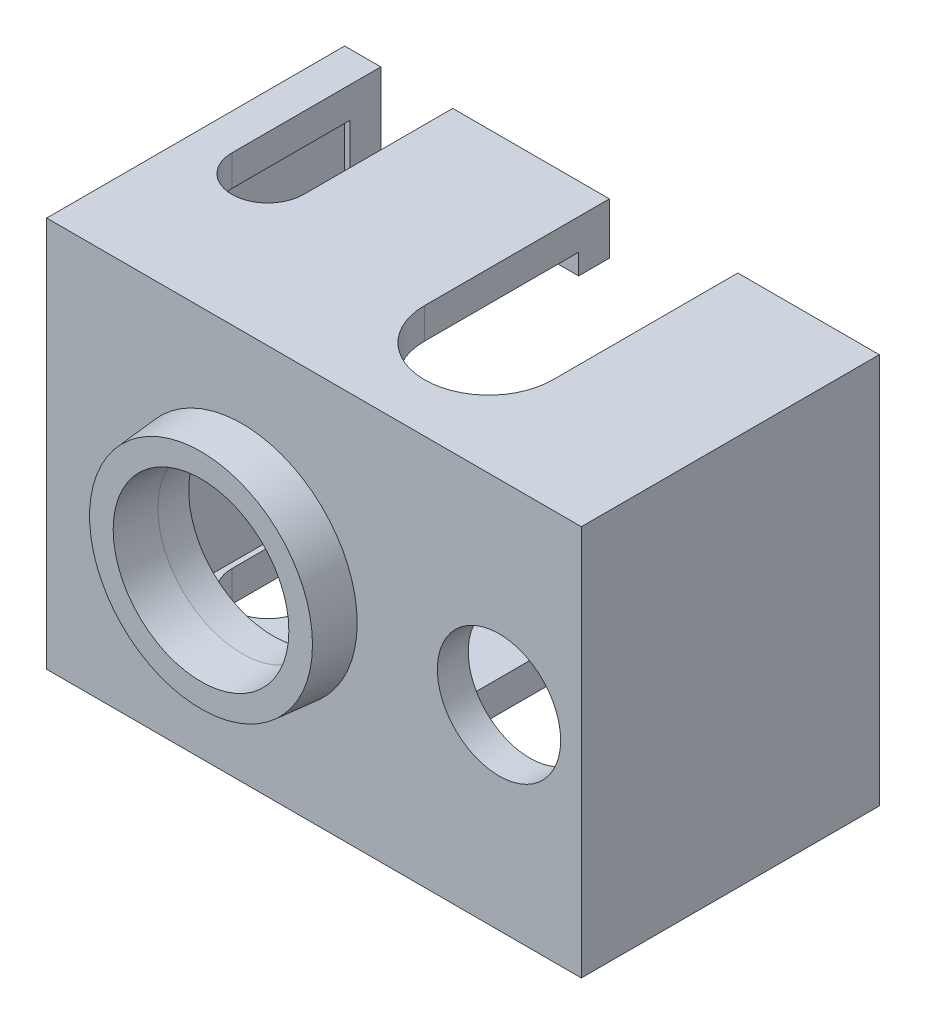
ISO-10303-21;
HEADER;
FILE_DESCRIPTION(('STEP AP214'),'2;1');
FILE_NAME('part.step','',(''),(''),'','','');
FILE_SCHEMA(('AUTOMOTIVE_DESIGN { 1 0 10303 214 1 1 1 1 }'));
ENDSEC;
DATA;
#1=APPLICATION_CONTEXT('core data for automotive mechanical design processes');
#2=APPLICATION_PROTOCOL_DEFINITION('international standard','automotive_design',2000,#1);
#3=PRODUCT_CONTEXT('',#1,'mechanical');
#4=PRODUCT('Part','Part','',(#3));
#5=PRODUCT_RELATED_PRODUCT_CATEGORY('part','',(#4));
#6=PRODUCT_DEFINITION_FORMATION('','',#4);
#7=PRODUCT_DEFINITION_CONTEXT('part definition',#1,'design');
#8=PRODUCT_DEFINITION('design','',#6,#7);
#9=PRODUCT_DEFINITION_SHAPE('','',#8);
#10=(LENGTH_UNIT() NAMED_UNIT(*) SI_UNIT(.MILLI.,.METRE.));
#11=(NAMED_UNIT(*) PLANE_ANGLE_UNIT() SI_UNIT($,.RADIAN.));
#12=(NAMED_UNIT(*) SI_UNIT($,.STERADIAN.) SOLID_ANGLE_UNIT());
#13=UNCERTAINTY_MEASURE_WITH_UNIT(LENGTH_MEASURE(1.E-05),#10,'distance_accuracy_value','');
#14=(GEOMETRIC_REPRESENTATION_CONTEXT(3) GLOBAL_UNCERTAINTY_ASSIGNED_CONTEXT((#13)) GLOBAL_UNIT_ASSIGNED_CONTEXT((#10,
#11,#12)) REPRESENTATION_CONTEXT('',''));
#15=CARTESIAN_POINT('',(0.,0.,0.));
#16=DIRECTION('',(0.,0.,1.));
#17=DIRECTION('',(1.,0.,0.));
#18=AXIS2_PLACEMENT_3D('',#15,#16,#17);
#19=CARTESIAN_POINT('',(0.,0.,-11.5));
#20=DIRECTION('',(0.,0.,-1.));
#21=DIRECTION('',(-1.,0.,0.));
#22=AXIS2_PLACEMENT_3D('',#19,#20,#21);
#23=PLANE('',#22);
#24=DIRECTION('',(-1.,0.,0.));
#25=VECTOR('',#24,1.);
#26=CARTESIAN_POINT('',(15.01,8.01,-11.5));
#27=LINE('',#26,#25);
#28=CARTESIAN_POINT('',(15.01,8.01,-11.5));
#29=VERTEX_POINT('',#28);
#30=CARTESIAN_POINT('',(9.62500000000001,8.01,-11.5));
#31=VERTEX_POINT('',#30);
#32=EDGE_CURVE('E449',#29,#31,#27,.T.);
#33=ORIENTED_EDGE('',*,*,#32,.T.);
#34=DIRECTION('',(0.,-1.,0.));
#35=VECTOR('',#34,1.);
#36=CARTESIAN_POINT('',(9.62500000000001,0.,-11.5));
#37=LINE('',#36,#35);
#38=CARTESIAN_POINT('',(9.62500000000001,7.01,-11.5));
#39=VERTEX_POINT('',#38);
#40=EDGE_CURVE('E341',#31,#39,#37,.T.);
#41=ORIENTED_EDGE('',*,*,#40,.T.);
#42=DIRECTION('',(1.,0.,0.));
#43=VECTOR('',#42,1.);
#44=CARTESIAN_POINT('',(-7.01,7.00999999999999,-11.5));
#45=LINE('',#44,#43);
#46=CARTESIAN_POINT('',(14.01,7.01,-11.5));
#47=VERTEX_POINT('',#46);
#48=EDGE_CURVE('E416',#39,#47,#45,.T.);
#49=ORIENTED_EDGE('',*,*,#48,.T.);
#50=DIRECTION('',(0.,-1.,0.));
#51=VECTOR('',#50,1.);
#52=CARTESIAN_POINT('',(14.01,7.01,-11.5));
#53=LINE('',#52,#51);
#54=CARTESIAN_POINT('',(14.01,-7.01,-11.5));
#55=VERTEX_POINT('',#54);
#56=EDGE_CURVE('E419',#47,#55,#53,.T.);
#57=ORIENTED_EDGE('',*,*,#56,.T.);
#58=DIRECTION('',(-1.,0.,0.));
#59=VECTOR('',#58,1.);
#60=CARTESIAN_POINT('',(14.01,-7.01,-11.5));
#61=LINE('',#60,#59);
#62=CARTESIAN_POINT('',(9.62500000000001,-7.01,-11.5));
#63=VERTEX_POINT('',#62);
#64=EDGE_CURVE('E413',#55,#63,#61,.T.);
#65=ORIENTED_EDGE('',*,*,#64,.T.);
#66=CARTESIAN_POINT('',(9.62500000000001,-8.01,-11.5));
#67=VERTEX_POINT('',#66);
#68=EDGE_CURVE('E345',#63,#67,#37,.T.);
#69=ORIENTED_EDGE('',*,*,#68,.T.);
#70=DIRECTION('',(1.,0.,0.));
#71=VECTOR('',#70,1.);
#72=CARTESIAN_POINT('',(15.01,-8.01,-11.5));
#73=LINE('',#72,#71);
#74=CARTESIAN_POINT('',(15.01,-8.01,-11.5));
#75=VERTEX_POINT('',#74);
#76=EDGE_CURVE('E456',#67,#75,#73,.T.);
#77=ORIENTED_EDGE('',*,*,#76,.T.);
#78=DIRECTION('',(0.,1.,0.));
#79=VECTOR('',#78,1.);
#80=CARTESIAN_POINT('',(15.01,8.01,-11.5));
#81=LINE('',#80,#79);
#82=EDGE_CURVE('E444',#75,#29,#81,.T.);
#83=ORIENTED_EDGE('',*,*,#82,.T.);
#84=EDGE_LOOP('',(#33,#41,#49,#57,#65,#69,#77,#83));
#85=FACE_BOUND('',#84,.T.);
#86=ADVANCED_FACE('F33',(#85),#23,.F.);
#87=CARTESIAN_POINT('',(-4.25000000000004,-8.01,-11.5));
#88=VERTEX_POINT('',#87);
#89=CARTESIAN_POINT('',(3.37500000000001,-8.01,-11.5));
#90=VERTEX_POINT('',#89);
#91=EDGE_CURVE('E461',#88,#90,#73,.T.);
#92=ORIENTED_EDGE('',*,*,#91,.T.);
#93=DIRECTION('',(0.,1.,0.));
#94=VECTOR('',#93,1.);
#95=CARTESIAN_POINT('',(3.37500000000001,0.,-11.5));
#96=LINE('',#95,#94);
#97=CARTESIAN_POINT('',(3.375,-7.01,-11.5));
#98=VERTEX_POINT('',#97);
#99=EDGE_CURVE('E334',#90,#98,#96,.T.);
#100=ORIENTED_EDGE('',*,*,#99,.T.);
#101=CARTESIAN_POINT('',(-4.25000000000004,-7.01,-11.5));
#102=VERTEX_POINT('',#101);
#103=EDGE_CURVE('E402',#98,#102,#61,.T.);
#104=ORIENTED_EDGE('',*,*,#103,.T.);
#105=DIRECTION('',(0.,-1.,0.));
#106=VECTOR('',#105,1.);
#107=CARTESIAN_POINT('',(-4.25000000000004,0.,-11.5));
#108=LINE('',#107,#106);
#109=EDGE_CURVE('E322',#102,#88,#108,.T.);
#110=ORIENTED_EDGE('',*,*,#109,.T.);
#111=EDGE_LOOP('',(#92,#100,#104,#110));
#112=FACE_BOUND('',#111,.T.);
#113=ADVANCED_FACE('F610',(#112),#23,.F.);
#114=CARTESIAN_POINT('',(-4.25000000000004,7.00999999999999,-11.5));
#115=VERTEX_POINT('',#114);
#116=CARTESIAN_POINT('',(3.375,7.00999999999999,-11.5));
#117=VERTEX_POINT('',#116);
#118=EDGE_CURVE('E418',#115,#117,#45,.T.);
#119=ORIENTED_EDGE('',*,*,#118,.T.);
#120=CARTESIAN_POINT('',(3.375,8.01,-11.5));
#121=VERTEX_POINT('',#120);
#122=EDGE_CURVE('E330',#117,#121,#96,.T.);
#123=ORIENTED_EDGE('',*,*,#122,.T.);
#124=CARTESIAN_POINT('',(-4.25000000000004,8.01,-11.5));
#125=VERTEX_POINT('',#124);
#126=EDGE_CURVE('E453',#121,#125,#27,.T.);
#127=ORIENTED_EDGE('',*,*,#126,.T.);
#128=EDGE_CURVE('E284',#125,#115,#108,.T.);
#129=ORIENTED_EDGE('',*,*,#128,.T.);
#130=EDGE_LOOP('',(#119,#123,#127,#129));
#131=FACE_BOUND('',#130,.T.);
#132=ADVANCED_FACE('F522',(#131),#23,.F.);
#133=CARTESIAN_POINT('',(0.,0.,-13.));
#134=DIRECTION('',(0.,0.,-1.));
#135=DIRECTION('',(-1.,0.,0.));
#136=AXIS2_PLACEMENT_3D('',#133,#134,#135);
#137=PLANE('',#136);
#138=DIRECTION('',(0.,-1.,0.));
#139=VECTOR('',#138,1.);
#140=CARTESIAN_POINT('',(9.62500000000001,9.51,-13.));
#141=LINE('',#140,#139);
#142=CARTESIAN_POINT('',(9.62500000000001,9.51,-13.));
#143=VERTEX_POINT('',#142);
#144=CARTESIAN_POINT('',(9.62500000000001,7.01,-13.));
#145=VERTEX_POINT('',#144);
#146=EDGE_CURVE('E286',#143,#145,#141,.T.);
#147=ORIENTED_EDGE('',*,*,#146,.F.);
#148=DIRECTION('',(1.,0.,0.));
#149=VECTOR('',#148,1.);
#150=CARTESIAN_POINT('',(-9.51,9.51,-13.));
#151=LINE('',#150,#149);
#152=CARTESIAN_POINT('',(16.51,9.51,-13.));
#153=VERTEX_POINT('',#152);
#154=EDGE_CURVE('E430',#143,#153,#151,.T.);
#155=ORIENTED_EDGE('',*,*,#154,.T.);
#156=DIRECTION('',(0.,-1.,0.));
#157=VECTOR('',#156,1.);
#158=CARTESIAN_POINT('',(16.51,9.51,-13.));
#159=LINE('',#158,#157);
#160=CARTESIAN_POINT('',(16.51,-9.51,-13.));
#161=VERTEX_POINT('',#160);
#162=EDGE_CURVE('E434',#153,#161,#159,.T.);
#163=ORIENTED_EDGE('',*,*,#162,.T.);
#164=DIRECTION('',(-1.,0.,0.));
#165=VECTOR('',#164,1.);
#166=CARTESIAN_POINT('',(16.51,-9.51,-13.));
#167=LINE('',#166,#165);
#168=CARTESIAN_POINT('',(9.62500000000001,-9.51,-13.));
#169=VERTEX_POINT('',#168);
#170=EDGE_CURVE('E439',#161,#169,#167,.T.);
#171=ORIENTED_EDGE('',*,*,#170,.T.);
#172=CARTESIAN_POINT('',(9.62500000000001,-7.01,-13.));
#173=VERTEX_POINT('',#172);
#174=EDGE_CURVE('E288',#173,#169,#141,.T.);
#175=ORIENTED_EDGE('',*,*,#174,.F.);
#176=DIRECTION('',(-1.,0.,0.));
#177=VECTOR('',#176,1.);
#178=CARTESIAN_POINT('',(14.01,-7.01,-13.));
#179=LINE('',#178,#177);
#180=CARTESIAN_POINT('',(14.01,-7.01,-13.));
#181=VERTEX_POINT('',#180);
#182=EDGE_CURVE('E403',#181,#173,#179,.T.);
#183=ORIENTED_EDGE('',*,*,#182,.F.);
#184=DIRECTION('',(0.,-1.,0.));
#185=VECTOR('',#184,1.);
#186=CARTESIAN_POINT('',(14.01,7.01,-13.));
#187=LINE('',#186,#185);
#188=CARTESIAN_POINT('',(14.01,7.01,-13.));
#189=VERTEX_POINT('',#188);
#190=EDGE_CURVE('E410',#189,#181,#187,.T.);
#191=ORIENTED_EDGE('',*,*,#190,.F.);
#192=DIRECTION('',(1.,0.,0.));
#193=VECTOR('',#192,1.);
#194=CARTESIAN_POINT('',(-7.01,7.00999999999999,-13.));
#195=LINE('',#194,#193);
#196=EDGE_CURVE('E406',#145,#189,#195,.T.);
#197=ORIENTED_EDGE('',*,*,#196,.F.);
#198=EDGE_LOOP('',(#147,#155,#163,#171,#175,#183,#191,#197));
#199=FACE_BOUND('',#198,.T.);
#200=ADVANCED_FACE('F573',(#199),#137,.T.);
#201=DIRECTION('',(0.,-1.,0.));
#202=VECTOR('',#201,1.);
#203=CARTESIAN_POINT('',(3.375,9.51,-13.));
#204=LINE('',#203,#202);
#205=CARTESIAN_POINT('',(3.375,-7.01,-13.));
#206=VERTEX_POINT('',#205);
#207=CARTESIAN_POINT('',(3.37500000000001,-9.51,-13.));
#208=VERTEX_POINT('',#207);
#209=EDGE_CURVE('E48',#206,#208,#204,.T.);
#210=ORIENTED_EDGE('',*,*,#209,.T.);
#211=CARTESIAN_POINT('',(-4.25000000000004,-9.51,-13.));
#212=VERTEX_POINT('',#211);
#213=EDGE_CURVE('E443',#208,#212,#167,.T.);
#214=ORIENTED_EDGE('',*,*,#213,.T.);
#215=DIRECTION('',(0.,-1.,0.));
#216=VECTOR('',#215,1.);
#217=CARTESIAN_POINT('',(-4.25000000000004,9.51,-13.));
#218=LINE('',#217,#216);
#219=CARTESIAN_POINT('',(-4.25000000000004,-7.01,-13.));
#220=VERTEX_POINT('',#219);
#221=EDGE_CURVE('E312',#220,#212,#218,.T.);
#222=ORIENTED_EDGE('',*,*,#221,.F.);
#223=EDGE_CURVE('E407',#206,#220,#179,.T.);
#224=ORIENTED_EDGE('',*,*,#223,.F.);
#225=EDGE_LOOP('',(#210,#214,#222,#224));
#226=FACE_BOUND('',#225,.T.);
#227=ADVANCED_FACE('F629',(#226),#137,.T.);
#228=CARTESIAN_POINT('',(3.375,9.51,-13.));
#229=VERTEX_POINT('',#228);
#230=CARTESIAN_POINT('',(3.375,7.00999999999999,-13.));
#231=VERTEX_POINT('',#230);
#232=EDGE_CURVE('E263',#229,#231,#204,.T.);
#233=ORIENTED_EDGE('',*,*,#232,.T.);
#234=CARTESIAN_POINT('',(-4.25000000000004,7.00999999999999,-13.));
#235=VERTEX_POINT('',#234);
#236=EDGE_CURVE('E409',#235,#231,#195,.T.);
#237=ORIENTED_EDGE('',*,*,#236,.F.);
#238=CARTESIAN_POINT('',(-4.25000000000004,9.51,-13.));
#239=VERTEX_POINT('',#238);
#240=EDGE_CURVE('E56',#239,#235,#218,.T.);
#241=ORIENTED_EDGE('',*,*,#240,.F.);
#242=EDGE_CURVE('E435',#239,#229,#151,.T.);
#243=ORIENTED_EDGE('',*,*,#242,.T.);
#244=EDGE_LOOP('',(#233,#237,#241,#243));
#245=FACE_BOUND('',#244,.T.);
#246=ADVANCED_FACE('F514',(#245),#137,.T.);
#247=CARTESIAN_POINT('',(14.01,-7.01,-13.));
#248=DIRECTION('',(0.,1.,0.));
#249=DIRECTION('',(-1.,0.,0.));
#250=AXIS2_PLACEMENT_3D('',#247,#248,#249);
#251=PLANE('',#250);
#252=DIRECTION('',(0.,0.,-1.));
#253=VECTOR('',#252,1.);
#254=CARTESIAN_POINT('',(9.62500000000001,-7.01,-13.));
#255=LINE('',#254,#253);
#256=EDGE_CURVE('E348',#63,#173,#255,.T.);
#257=ORIENTED_EDGE('',*,*,#256,.F.);
#258=ORIENTED_EDGE('',*,*,#64,.F.);
#259=DIRECTION('',(0.,0.,1.));
#260=VECTOR('',#259,1.);
#261=CARTESIAN_POINT('',(14.01,-7.01,-13.));
#262=LINE('',#261,#260);
#263=EDGE_CURVE('E412',#181,#55,#262,.T.);
#264=ORIENTED_EDGE('',*,*,#263,.F.);
#265=ORIENTED_EDGE('',*,*,#182,.T.);
#266=EDGE_LOOP('',(#257,#258,#264,#265));
#267=FACE_BOUND('',#266,.T.);
#268=ADVANCED_FACE('F605',(#267),#251,.T.);
#269=CARTESIAN_POINT('',(-7.01,7.00999999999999,-13.));
#270=DIRECTION('',(0.,-1.,0.));
#271=DIRECTION('',(1.,0.,0.));
#272=AXIS2_PLACEMENT_3D('',#269,#270,#271);
#273=PLANE('',#272);
#274=DIRECTION('',(0.,0.,1.));
#275=VECTOR('',#274,1.);
#276=CARTESIAN_POINT('',(9.62500000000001,7.01,-13.));
#277=LINE('',#276,#275);
#278=EDGE_CURVE('E497',#145,#39,#277,.T.);
#279=ORIENTED_EDGE('',*,*,#278,.F.);
#280=ORIENTED_EDGE('',*,*,#196,.T.);
#281=DIRECTION('',(0.,0.,1.));
#282=VECTOR('',#281,1.);
#283=CARTESIAN_POINT('',(14.01,7.01,-13.));
#284=LINE('',#283,#282);
#285=EDGE_CURVE('E424',#189,#47,#284,.T.);
#286=ORIENTED_EDGE('',*,*,#285,.T.);
#287=ORIENTED_EDGE('',*,*,#48,.F.);
#288=EDGE_LOOP('',(#279,#280,#286,#287));
#289=FACE_BOUND('',#288,.T.);
#290=ADVANCED_FACE('F581',(#289),#273,.T.);
#291=CARTESIAN_POINT('',(0.,0.,1.5));
#292=DIRECTION('',(0.,0.,1.));
#293=DIRECTION('',(1.,0.,0.));
#294=AXIS2_PLACEMENT_3D('',#291,#292,#293);
#295=PLANE('',#294);
#296=CARTESIAN_POINT('',(12.5025265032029,1.05845608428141E-09,1.5));
#297=DIRECTION('',(0.,0.,1.));
#298=DIRECTION('',(1.,0.,0.));
#299=AXIS2_PLACEMENT_3D('',#296,#297,#298);
#300=CIRCLE('',#299,3.);
#301=CARTESIAN_POINT('',(15.5025265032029,1.05845608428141E-09,1.5));
#302=VERTEX_POINT('',#301);
#303=EDGE_CURVE('E368',#302,#302,#300,.T.);
#304=ORIENTED_EDGE('',*,*,#303,.F.);
#305=EDGE_LOOP('',(#304));
#306=FACE_BOUND('',#305,.T.);
#307=DIRECTION('',(0.,1.,0.));
#308=VECTOR('',#307,1.);
#309=CARTESIAN_POINT('',(16.51,-9.51,1.5));
#310=LINE('',#309,#308);
#311=CARTESIAN_POINT('',(16.51,-9.51,1.5));
#312=VERTEX_POINT('',#311);
#313=CARTESIAN_POINT('',(16.51,9.51,1.5));
#314=VERTEX_POINT('',#313);
#315=EDGE_CURVE('E390',#312,#314,#310,.T.);
#316=ORIENTED_EDGE('',*,*,#315,.T.);
#317=DIRECTION('',(-1.,0.,0.));
#318=VECTOR('',#317,1.);
#319=CARTESIAN_POINT('',(16.51,9.51,1.5));
#320=LINE('',#319,#318);
#321=CARTESIAN_POINT('',(-9.51,9.51,1.5));
#322=VERTEX_POINT('',#321);
#323=EDGE_CURVE('E393',#314,#322,#320,.T.);
#324=ORIENTED_EDGE('',*,*,#323,.T.);
#325=DIRECTION('',(0.,-1.,0.));
#326=VECTOR('',#325,1.);
#327=CARTESIAN_POINT('',(-9.51,9.51,1.5));
#328=LINE('',#327,#326);
#329=CARTESIAN_POINT('',(-9.51,-9.51,1.5));
#330=VERTEX_POINT('',#329);
#331=EDGE_CURVE('E396',#322,#330,#328,.T.);
#332=ORIENTED_EDGE('',*,*,#331,.T.);
#333=DIRECTION('',(1.,0.,0.));
#334=VECTOR('',#333,1.);
#335=CARTESIAN_POINT('',(-9.51,-9.51,1.5));
#336=LINE('',#335,#334);
#337=EDGE_CURVE('E399',#330,#312,#336,.T.);
#338=ORIENTED_EDGE('',*,*,#337,.T.);
#339=EDGE_LOOP('',(#316,#324,#332,#338));
#340=FACE_BOUND('',#339,.T.);
#341=CARTESIAN_POINT('',(0.,0.,1.5));
#342=DIRECTION('',(0.,0.,1.));
#343=DIRECTION('',(1.,0.,0.));
#344=AXIS2_PLACEMENT_3D('',#341,#342,#343);
#345=CIRCLE('',#344,5.6);
#346=CARTESIAN_POINT('',(5.6,0.,1.5));
#347=VERTEX_POINT('',#346);
#348=EDGE_CURVE('E379',#347,#347,#345,.T.);
#349=ORIENTED_EDGE('',*,*,#348,.F.);
#350=EDGE_LOOP('',(#349));
#351=FACE_BOUND('',#350,.T.);
#352=ADVANCED_FACE('F562',(#306,#340,#351),#295,.T.);
#353=CARTESIAN_POINT('',(16.51,9.51,-11.5));
#354=DIRECTION('',(0.,1.,0.));
#355=DIRECTION('',(-1.,0.,0.));
#356=AXIS2_PLACEMENT_3D('',#353,#354,#355);
#357=PLANE('',#356);
#358=DIRECTION('',(0.,0.,1.));
#359=VECTOR('',#358,1.);
#360=CARTESIAN_POINT('',(9.62500000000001,9.51,-13.));
#361=LINE('',#360,#359);
#362=CARTESIAN_POINT('',(9.62500000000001,9.51,-4.));
#363=VERTEX_POINT('',#362);
#364=EDGE_CURVE('E267',#143,#363,#361,.T.);
#365=ORIENTED_EDGE('',*,*,#364,.T.);
#366=CARTESIAN_POINT('',(6.5,9.51,-4.));
#367=DIRECTION('',(0.,-1.,0.));
#368=DIRECTION('',(1.,0.,0.));
#369=AXIS2_PLACEMENT_3D('',#366,#367,#368);
#370=CIRCLE('',#369,3.125);
#371=CARTESIAN_POINT('',(3.375,9.51,-4.));
#372=VERTEX_POINT('',#371);
#373=EDGE_CURVE('E253',#363,#372,#370,.T.);
#374=ORIENTED_EDGE('',*,*,#373,.T.);
#375=DIRECTION('',(0.,0.,-1.));
#376=VECTOR('',#375,1.);
#377=CARTESIAN_POINT('',(3.375,9.51,-4.));
#378=LINE('',#377,#376);
#379=EDGE_CURVE('E260',#372,#229,#378,.T.);
#380=ORIENTED_EDGE('',*,*,#379,.T.);
#381=ORIENTED_EDGE('',*,*,#242,.F.);
#382=DIRECTION('',(0.,0.,1.));
#383=VECTOR('',#382,1.);
#384=CARTESIAN_POINT('',(-4.25000000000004,9.51,-5.75000000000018));
#385=LINE('',#384,#383);
#386=CARTESIAN_POINT('',(-4.25000000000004,9.51,-5.75000000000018));
#387=VERTEX_POINT('',#386);
#388=EDGE_CURVE('E297',#239,#387,#385,.T.);
#389=ORIENTED_EDGE('',*,*,#388,.T.);
#390=CARTESIAN_POINT('',(-6.00000000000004,9.51,-5.75000000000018));
#391=DIRECTION('',(0.,-1.,0.));
#392=DIRECTION('',(1.,0.,0.));
#393=AXIS2_PLACEMENT_3D('',#390,#391,#392);
#394=CIRCLE('',#393,1.75);
#395=CARTESIAN_POINT('',(-7.75000000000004,9.51,-5.75000000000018));
#396=VERTEX_POINT('',#395);
#397=EDGE_CURVE('E290',#387,#396,#394,.T.);
#398=ORIENTED_EDGE('',*,*,#397,.T.);
#399=DIRECTION('',(0.,0.,-1.));
#400=VECTOR('',#399,1.);
#401=CARTESIAN_POINT('',(-7.75000000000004,9.51,-13.));
#402=LINE('',#401,#400);
#403=CARTESIAN_POINT('',(-7.75000000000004,9.51,-13.));
#404=VERTEX_POINT('',#403);
#405=EDGE_CURVE('E293',#396,#404,#402,.T.);
#406=ORIENTED_EDGE('',*,*,#405,.T.);
#407=CARTESIAN_POINT('',(-9.51,9.51,-13.));
#408=VERTEX_POINT('',#407);
#409=EDGE_CURVE('E431',#408,#404,#151,.T.);
#410=ORIENTED_EDGE('',*,*,#409,.F.);
#411=DIRECTION('',(0.,0.,1.));
#412=VECTOR('',#411,1.);
#413=CARTESIAN_POINT('',(-9.51,9.51,-11.5));
#414=LINE('',#413,#412);
#415=EDGE_CURVE('E477',#408,#322,#414,.T.);
#416=ORIENTED_EDGE('',*,*,#415,.T.);
#417=ORIENTED_EDGE('',*,*,#323,.F.);
#418=DIRECTION('',(0.,0.,1.));
#419=VECTOR('',#418,1.);
#420=CARTESIAN_POINT('',(16.51,9.51,-11.5));
#421=LINE('',#420,#419);
#422=EDGE_CURVE('E486',#153,#314,#421,.T.);
#423=ORIENTED_EDGE('',*,*,#422,.F.);
#424=ORIENTED_EDGE('',*,*,#154,.F.);
#425=EDGE_LOOP('',(#365,#374,#380,#381,#389,#398,#406,#410,#416,#417,#423,#424));
#426=FACE_BOUND('',#425,.T.);
#427=ADVANCED_FACE('F35',(#426),#357,.T.);
#428=CARTESIAN_POINT('',(16.51,9.51,-11.5));
#429=DIRECTION('',(1.,0.,0.));
#430=DIRECTION('',(0.,1.,0.));
#431=AXIS2_PLACEMENT_3D('',#428,#429,#430);
#432=PLANE('',#431);
#433=ORIENTED_EDGE('',*,*,#422,.T.);
#434=ORIENTED_EDGE('',*,*,#315,.F.);
#435=DIRECTION('',(0.,0.,1.));
#436=VECTOR('',#435,1.);
#437=CARTESIAN_POINT('',(16.51,-9.51,-11.5));
#438=LINE('',#437,#436);
#439=EDGE_CURVE('E489',#161,#312,#438,.T.);
#440=ORIENTED_EDGE('',*,*,#439,.F.);
#441=ORIENTED_EDGE('',*,*,#162,.F.);
#442=EDGE_LOOP('',(#433,#434,#440,#441));
#443=FACE_BOUND('',#442,.T.);
#444=ADVANCED_FACE('F569',(#443),#432,.T.);
#445=CARTESIAN_POINT('',(16.51,-9.51,-11.5));
#446=DIRECTION('',(0.,-1.,0.));
#447=DIRECTION('',(1.,0.,0.));
#448=AXIS2_PLACEMENT_3D('',#445,#446,#447);
#449=PLANE('',#448);
#450=DIRECTION('',(0.,0.,1.));
#451=VECTOR('',#450,1.);
#452=CARTESIAN_POINT('',(9.62500000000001,-9.51,-13.));
#453=LINE('',#452,#451);
#454=CARTESIAN_POINT('',(9.62500000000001,-9.51,-4.));
#455=VERTEX_POINT('',#454);
#456=EDGE_CURVE('E270',#169,#455,#453,.T.);
#457=ORIENTED_EDGE('',*,*,#456,.F.);
#458=ORIENTED_EDGE('',*,*,#170,.F.);
#459=ORIENTED_EDGE('',*,*,#439,.T.);
#460=ORIENTED_EDGE('',*,*,#337,.F.);
#461=DIRECTION('',(0.,0.,1.));
#462=VECTOR('',#461,1.);
#463=CARTESIAN_POINT('',(-9.51,-9.51,-11.5));
#464=LINE('',#463,#462);
#465=CARTESIAN_POINT('',(-9.51,-9.51,-13.));
#466=VERTEX_POINT('',#465);
#467=EDGE_CURVE('E491',#466,#330,#464,.T.);
#468=ORIENTED_EDGE('',*,*,#467,.F.);
#469=CARTESIAN_POINT('',(-7.75000000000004,-9.51,-13.));
#470=VERTEX_POINT('',#469);
#471=EDGE_CURVE('E438',#470,#466,#167,.T.);
#472=ORIENTED_EDGE('',*,*,#471,.F.);
#473=DIRECTION('',(0.,0.,-1.));
#474=VECTOR('',#473,1.);
#475=CARTESIAN_POINT('',(-7.75000000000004,-9.51,-13.));
#476=LINE('',#475,#474);
#477=CARTESIAN_POINT('',(-7.75000000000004,-9.51,-5.75000000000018));
#478=VERTEX_POINT('',#477);
#479=EDGE_CURVE('E304',#478,#470,#476,.T.);
#480=ORIENTED_EDGE('',*,*,#479,.F.);
#481=CARTESIAN_POINT('',(-6.00000000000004,-9.51,-5.75000000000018));
#482=DIRECTION('',(0.,-1.,0.));
#483=DIRECTION('',(1.,0.,0.));
#484=AXIS2_PLACEMENT_3D('',#481,#482,#483);
#485=CIRCLE('',#484,1.75);
#486=CARTESIAN_POINT('',(-4.25000000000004,-9.51,-5.75000000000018));
#487=VERTEX_POINT('',#486);
#488=EDGE_CURVE('E301',#487,#478,#485,.T.);
#489=ORIENTED_EDGE('',*,*,#488,.F.);
#490=DIRECTION('',(0.,0.,1.));
#491=VECTOR('',#490,1.);
#492=CARTESIAN_POINT('',(-4.25000000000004,-9.51,-5.75000000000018));
#493=LINE('',#492,#491);
#494=EDGE_CURVE('E294',#212,#487,#493,.T.);
#495=ORIENTED_EDGE('',*,*,#494,.F.);
#496=ORIENTED_EDGE('',*,*,#213,.F.);
#497=DIRECTION('',(0.,0.,-1.));
#498=VECTOR('',#497,1.);
#499=CARTESIAN_POINT('',(3.37500000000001,-9.51,-4.));
#500=LINE('',#499,#498);
#501=CARTESIAN_POINT('',(3.37500000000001,-9.51,-4.));
#502=VERTEX_POINT('',#501);
#503=EDGE_CURVE('E273',#502,#208,#500,.T.);
#504=ORIENTED_EDGE('',*,*,#503,.F.);
#505=CARTESIAN_POINT('',(6.50000000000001,-9.51,-4.));
#506=DIRECTION('',(0.,-1.,0.));
#507=DIRECTION('',(1.,0.,0.));
#508=AXIS2_PLACEMENT_3D('',#505,#506,#507);
#509=CIRCLE('',#508,3.125);
#510=EDGE_CURVE('E277',#455,#502,#509,.T.);
#511=ORIENTED_EDGE('',*,*,#510,.F.);
#512=EDGE_LOOP('',(#457,#458,#459,#460,#468,#472,#480,#489,#495,#496,#504,#511));
#513=FACE_BOUND('',#512,.T.);
#514=ADVANCED_FACE('F552',(#513),#449,.T.);
#515=CARTESIAN_POINT('',(-9.51,9.51,-11.5));
#516=DIRECTION('',(-1.,0.,0.));
#517=DIRECTION('',(0.,-1.,0.));
#518=AXIS2_PLACEMENT_3D('',#515,#516,#517);
#519=PLANE('',#518);
#520=ORIENTED_EDGE('',*,*,#467,.T.);
#521=ORIENTED_EDGE('',*,*,#331,.F.);
#522=ORIENTED_EDGE('',*,*,#415,.F.);
#523=DIRECTION('',(0.,1.,0.));
#524=VECTOR('',#523,1.);
#525=CARTESIAN_POINT('',(-9.51,-9.51,-13.));
#526=LINE('',#525,#524);
#527=EDGE_CURVE('E427',#466,#408,#526,.T.);
#528=ORIENTED_EDGE('',*,*,#527,.F.);
#529=EDGE_LOOP('',(#520,#521,#522,#528));
#530=FACE_BOUND('',#529,.T.);
#531=ADVANCED_FACE('F566',(#530),#519,.T.);
#532=CARTESIAN_POINT('',(15.01,8.01,-11.5));
#533=DIRECTION('',(1.,0.,0.));
#534=DIRECTION('',(0.,1.,0.));
#535=AXIS2_PLACEMENT_3D('',#532,#533,#534);
#536=PLANE('',#535);
#537=DIRECTION('',(0.,1.,0.));
#538=VECTOR('',#537,1.);
#539=CARTESIAN_POINT('',(15.01,8.01,0.));
#540=LINE('',#539,#538);
#541=CARTESIAN_POINT('',(15.01,-8.01,0.));
#542=VERTEX_POINT('',#541);
#543=CARTESIAN_POINT('',(15.01,-1.64699018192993,0.));
#544=VERTEX_POINT('',#543);
#545=EDGE_CURVE('E462',#542,#544,#540,.T.);
#546=ORIENTED_EDGE('',*,*,#545,.T.);
#547=CARTESIAN_POINT('',(15.01,1.64699018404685,0.));
#548=VERTEX_POINT('',#547);
#549=EDGE_CURVE('E466',#544,#548,#540,.T.);
#550=ORIENTED_EDGE('',*,*,#549,.T.);
#551=CARTESIAN_POINT('',(15.01,8.01,0.));
#552=VERTEX_POINT('',#551);
#553=EDGE_CURVE('E442',#548,#552,#540,.T.);
#554=ORIENTED_EDGE('',*,*,#553,.T.);
#555=DIRECTION('',(0.,0.,1.));
#556=VECTOR('',#555,1.);
#557=CARTESIAN_POINT('',(15.01,8.01,-11.5));
#558=LINE('',#557,#556);
#559=EDGE_CURVE('E460',#29,#552,#558,.T.);
#560=ORIENTED_EDGE('',*,*,#559,.F.);
#561=ORIENTED_EDGE('',*,*,#82,.F.);
#562=DIRECTION('',(0.,0.,1.));
#563=VECTOR('',#562,1.);
#564=CARTESIAN_POINT('',(15.01,-8.01,-11.5));
#565=LINE('',#564,#563);
#566=EDGE_CURVE('E474',#75,#542,#565,.T.);
#567=ORIENTED_EDGE('',*,*,#566,.T.);
#568=EDGE_LOOP('',(#546,#550,#554,#560,#561,#567));
#569=FACE_BOUND('',#568,.T.);
#570=ADVANCED_FACE('F588',(#569),#536,.F.);
#571=CARTESIAN_POINT('',(15.01,-8.01,-11.5));
#572=DIRECTION('',(0.,-1.,0.));
#573=DIRECTION('',(1.,0.,0.));
#574=AXIS2_PLACEMENT_3D('',#571,#572,#573);
#575=PLANE('',#574);
#576=ORIENTED_EDGE('',*,*,#76,.F.);
#577=DIRECTION('',(0.,0.,1.));
#578=VECTOR('',#577,1.);
#579=CARTESIAN_POINT('',(9.62500000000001,-8.01,-11.5));
#580=LINE('',#579,#578);
#581=CARTESIAN_POINT('',(9.62500000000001,-8.01,-4.));
#582=VERTEX_POINT('',#581);
#583=EDGE_CURVE('E350',#67,#582,#580,.T.);
#584=ORIENTED_EDGE('',*,*,#583,.T.);
#585=CARTESIAN_POINT('',(6.50000000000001,-8.01,-4.));
#586=DIRECTION('',(0.,-1.,0.));
#587=DIRECTION('',(1.,0.,0.));
#588=AXIS2_PLACEMENT_3D('',#585,#586,#587);
#589=CIRCLE('',#588,3.125);
#590=CARTESIAN_POINT('',(3.37500000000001,-8.01,-4.));
#591=VERTEX_POINT('',#590);
#592=EDGE_CURVE('E365',#582,#591,#589,.T.);
#593=ORIENTED_EDGE('',*,*,#592,.T.);
#594=DIRECTION('',(0.,0.,-1.));
#595=VECTOR('',#594,1.);
#596=CARTESIAN_POINT('',(3.37500000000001,-8.01,-11.5));
#597=LINE('',#596,#595);
#598=EDGE_CURVE('E338',#591,#90,#597,.T.);
#599=ORIENTED_EDGE('',*,*,#598,.T.);
#600=ORIENTED_EDGE('',*,*,#91,.F.);
#601=DIRECTION('',(0.,0.,1.));
#602=VECTOR('',#601,1.);
#603=CARTESIAN_POINT('',(-4.25000000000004,-8.01,-11.5));
#604=LINE('',#603,#602);
#605=CARTESIAN_POINT('',(-4.25000000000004,-8.01,-5.75000000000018));
#606=VERTEX_POINT('',#605);
#607=EDGE_CURVE('E327',#88,#606,#604,.T.);
#608=ORIENTED_EDGE('',*,*,#607,.T.);
#609=CARTESIAN_POINT('',(-6.00000000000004,-8.01,-5.75000000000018));
#610=DIRECTION('',(0.,-1.,0.));
#611=DIRECTION('',(1.,0.,0.));
#612=AXIS2_PLACEMENT_3D('',#609,#610,#611);
#613=CIRCLE('',#612,1.75);
#614=CARTESIAN_POINT('',(-7.75000000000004,-8.01,-5.75000000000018));
#615=VERTEX_POINT('',#614);
#616=EDGE_CURVE('E362',#606,#615,#613,.T.);
#617=ORIENTED_EDGE('',*,*,#616,.T.);
#618=DIRECTION('',(0.,0.,-1.));
#619=VECTOR('',#618,1.);
#620=CARTESIAN_POINT('',(-7.75000000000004,-8.01,-11.5));
#621=LINE('',#620,#619);
#622=CARTESIAN_POINT('',(-7.75000000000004,-8.01,-11.5));
#623=VERTEX_POINT('',#622);
#624=EDGE_CURVE('E359',#615,#623,#621,.T.);
#625=ORIENTED_EDGE('',*,*,#624,.T.);
#626=CARTESIAN_POINT('',(-8.01,-8.01,-11.5));
#627=VERTEX_POINT('',#626);
#628=EDGE_CURVE('E457',#627,#623,#73,.T.);
#629=ORIENTED_EDGE('',*,*,#628,.F.);
#630=DIRECTION('',(0.,0.,1.));
#631=VECTOR('',#630,1.);
#632=CARTESIAN_POINT('',(-8.01,-8.01,-11.5));
#633=LINE('',#632,#631);
#634=CARTESIAN_POINT('',(-8.01,-8.01,0.));
#635=VERTEX_POINT('',#634);
#636=EDGE_CURVE('E478',#627,#635,#633,.T.);
#637=ORIENTED_EDGE('',*,*,#636,.T.);
#638=DIRECTION('',(1.,0.,0.));
#639=VECTOR('',#638,1.);
#640=CARTESIAN_POINT('',(15.01,-8.01,0.));
#641=LINE('',#640,#639);
#642=EDGE_CURVE('E448',#635,#542,#641,.T.);
#643=ORIENTED_EDGE('',*,*,#642,.T.);
#644=ORIENTED_EDGE('',*,*,#566,.F.);
#645=EDGE_LOOP('',(#576,#584,#593,#599,#600,#608,#617,#625,#629,#637,#643,#644));
#646=FACE_BOUND('',#645,.T.);
#647=ADVANCED_FACE('F541',(#646),#575,.F.);
#648=CARTESIAN_POINT('',(-8.01,8.00999999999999,-11.5));
#649=DIRECTION('',(-1.,0.,0.));
#650=DIRECTION('',(0.,-1.,0.));
#651=AXIS2_PLACEMENT_3D('',#648,#649,#650);
#652=PLANE('',#651);
#653=DIRECTION('',(0.,-1.,0.));
#654=VECTOR('',#653,1.);
#655=CARTESIAN_POINT('',(-8.01,8.00999999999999,0.));
#656=LINE('',#655,#654);
#657=CARTESIAN_POINT('',(-8.01,8.00999999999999,0.));
#658=VERTEX_POINT('',#657);
#659=EDGE_CURVE('E469',#658,#635,#656,.T.);
#660=ORIENTED_EDGE('',*,*,#659,.T.);
#661=ORIENTED_EDGE('',*,*,#636,.F.);
#662=DIRECTION('',(0.,-1.,0.));
#663=VECTOR('',#662,1.);
#664=CARTESIAN_POINT('',(-8.01,8.00999999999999,-11.5));
#665=LINE('',#664,#663);
#666=CARTESIAN_POINT('',(-8.01,8.00999999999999,-11.5));
#667=VERTEX_POINT('',#666);
#668=EDGE_CURVE('E452',#667,#627,#665,.T.);
#669=ORIENTED_EDGE('',*,*,#668,.F.);
#670=DIRECTION('',(0.,0.,1.));
#671=VECTOR('',#670,1.);
#672=CARTESIAN_POINT('',(-8.01,8.00999999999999,-11.5));
#673=LINE('',#672,#671);
#674=EDGE_CURVE('E481',#667,#658,#673,.T.);
#675=ORIENTED_EDGE('',*,*,#674,.T.);
#676=EDGE_LOOP('',(#660,#661,#669,#675));
#677=FACE_BOUND('',#676,.T.);
#678=ADVANCED_FACE('F529',(#677),#652,.F.);
#679=CARTESIAN_POINT('',(15.01,8.01,-11.5));
#680=DIRECTION('',(0.,1.,0.));
#681=DIRECTION('',(-1.,0.,0.));
#682=AXIS2_PLACEMENT_3D('',#679,#680,#681);
#683=PLANE('',#682);
#684=CARTESIAN_POINT('',(6.5,8.01,-4.));
#685=DIRECTION('',(0.,1.,0.));
#686=DIRECTION('',(-1.,0.,0.));
#687=AXIS2_PLACEMENT_3D('',#684,#685,#686);
#688=CIRCLE('',#687,3.125);
#689=CARTESIAN_POINT('',(3.375,8.00999999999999,-4.));
#690=VERTEX_POINT('',#689);
#691=CARTESIAN_POINT('',(9.62500000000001,8.01,-4.));
#692=VERTEX_POINT('',#691);
#693=EDGE_CURVE('E11',#690,#692,#688,.T.);
#694=ORIENTED_EDGE('',*,*,#693,.T.);
#695=DIRECTION('',(0.,0.,-1.));
#696=VECTOR('',#695,1.);
#697=CARTESIAN_POINT('',(9.62500000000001,8.01,-11.5));
#698=LINE('',#697,#696);
#699=EDGE_CURVE('E344',#692,#31,#698,.T.);
#700=ORIENTED_EDGE('',*,*,#699,.T.);
#701=ORIENTED_EDGE('',*,*,#32,.F.);
#702=ORIENTED_EDGE('',*,*,#559,.T.);
#703=DIRECTION('',(-1.,0.,0.));
#704=VECTOR('',#703,1.);
#705=CARTESIAN_POINT('',(15.01,8.01,0.));
#706=LINE('',#705,#704);
#707=EDGE_CURVE('E465',#552,#658,#706,.T.);
#708=ORIENTED_EDGE('',*,*,#707,.T.);
#709=ORIENTED_EDGE('',*,*,#674,.F.);
#710=CARTESIAN_POINT('',(-7.75000000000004,8.01,-11.5));
#711=VERTEX_POINT('',#710);
#712=EDGE_CURVE('E447',#711,#667,#27,.T.);
#713=ORIENTED_EDGE('',*,*,#712,.F.);
#714=DIRECTION('',(0.,0.,1.));
#715=VECTOR('',#714,1.);
#716=CARTESIAN_POINT('',(-7.75000000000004,8.00999999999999,-11.5));
#717=LINE('',#716,#715);
#718=CARTESIAN_POINT('',(-7.75000000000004,8.00999999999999,-5.75000000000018));
#719=VERTEX_POINT('',#718);
#720=EDGE_CURVE('E356',#711,#719,#717,.T.);
#721=ORIENTED_EDGE('',*,*,#720,.T.);
#722=CARTESIAN_POINT('',(-6.00000000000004,8.00999999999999,-5.75000000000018));
#723=DIRECTION('',(0.,1.,0.));
#724=DIRECTION('',(-1.,0.,0.));
#725=AXIS2_PLACEMENT_3D('',#722,#723,#724);
#726=CIRCLE('',#725,1.75);
#727=CARTESIAN_POINT('',(-4.25000000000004,8.00999999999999,-5.75000000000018));
#728=VERTEX_POINT('',#727);
#729=EDGE_CURVE('E41',#719,#728,#726,.T.);
#730=ORIENTED_EDGE('',*,*,#729,.T.);
#731=DIRECTION('',(0.,0.,-1.));
#732=VECTOR('',#731,1.);
#733=CARTESIAN_POINT('',(-4.25000000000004,8.00999999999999,-11.5));
#734=LINE('',#733,#732);
#735=EDGE_CURVE('E321',#728,#125,#734,.T.);
#736=ORIENTED_EDGE('',*,*,#735,.T.);
#737=ORIENTED_EDGE('',*,*,#126,.F.);
#738=DIRECTION('',(0.,0.,1.));
#739=VECTOR('',#738,1.);
#740=CARTESIAN_POINT('',(3.375,8.00999999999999,-11.5));
#741=LINE('',#740,#739);
#742=EDGE_CURVE('E333',#121,#690,#741,.T.);
#743=ORIENTED_EDGE('',*,*,#742,.T.);
#744=EDGE_LOOP('',(#694,#700,#701,#702,#708,#709,#713,#721,#730,#736,#737,#743));
#745=FACE_BOUND('',#744,.T.);
#746=ADVANCED_FACE('F500',(#745),#683,.F.);
#747=ORIENTED_EDGE('',*,*,#628,.T.);
#748=DIRECTION('',(0.,1.,0.));
#749=VECTOR('',#748,1.);
#750=CARTESIAN_POINT('',(-7.75000000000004,0.,-11.5));
#751=LINE('',#750,#749);
#752=EDGE_CURVE('E353',#623,#711,#751,.T.);
#753=ORIENTED_EDGE('',*,*,#752,.T.);
#754=ORIENTED_EDGE('',*,*,#712,.T.);
#755=ORIENTED_EDGE('',*,*,#668,.T.);
#756=EDGE_LOOP('',(#747,#753,#754,#755));
#757=FACE_BOUND('',#756,.T.);
#758=ADVANCED_FACE('F525',(#757),#23,.F.);
#759=DIRECTION('',(0.,-1.,0.));
#760=VECTOR('',#759,1.);
#761=CARTESIAN_POINT('',(-7.75000000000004,9.51,-13.));
#762=LINE('',#761,#760);
#763=EDGE_CURVE('E313',#404,#470,#762,.T.);
#764=ORIENTED_EDGE('',*,*,#763,.T.);
#765=ORIENTED_EDGE('',*,*,#471,.T.);
#766=ORIENTED_EDGE('',*,*,#527,.T.);
#767=ORIENTED_EDGE('',*,*,#409,.T.);
#768=EDGE_LOOP('',(#764,#765,#766,#767));
#769=FACE_BOUND('',#768,.T.);
#770=ADVANCED_FACE('F555',(#769),#137,.T.);
#771=DIRECTION('',(0.,0.,1.));
#772=VECTOR('',#771,1.);
#773=CARTESIAN_POINT('',(3.375,-7.01,-13.));
#774=LINE('',#773,#772);
#775=EDGE_CURVE('E336',#206,#98,#774,.T.);
#776=ORIENTED_EDGE('',*,*,#775,.F.);
#777=ORIENTED_EDGE('',*,*,#223,.T.);
#778=DIRECTION('',(0.,0.,-1.));
#779=VECTOR('',#778,1.);
#780=CARTESIAN_POINT('',(-4.25000000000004,-7.01,-13.));
#781=LINE('',#780,#779);
#782=EDGE_CURVE('E325',#102,#220,#781,.T.);
#783=ORIENTED_EDGE('',*,*,#782,.F.);
#784=ORIENTED_EDGE('',*,*,#103,.F.);
#785=EDGE_LOOP('',(#776,#777,#783,#784));
#786=FACE_BOUND('',#785,.T.);
#787=ADVANCED_FACE('F623',(#786),#251,.T.);
#788=DIRECTION('',(0.,0.,-1.));
#789=VECTOR('',#788,1.);
#790=CARTESIAN_POINT('',(3.375,7.00999999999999,-13.));
#791=LINE('',#790,#789);
#792=EDGE_CURVE('E495',#117,#231,#791,.T.);
#793=ORIENTED_EDGE('',*,*,#792,.F.);
#794=ORIENTED_EDGE('',*,*,#118,.F.);
#795=DIRECTION('',(0.,0.,1.));
#796=VECTOR('',#795,1.);
#797=CARTESIAN_POINT('',(-4.25000000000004,7.00999999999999,-13.));
#798=LINE('',#797,#796);
#799=EDGE_CURVE('E488',#235,#115,#798,.T.);
#800=ORIENTED_EDGE('',*,*,#799,.F.);
#801=ORIENTED_EDGE('',*,*,#236,.T.);
#802=EDGE_LOOP('',(#793,#794,#800,#801));
#803=FACE_BOUND('',#802,.T.);
#804=ADVANCED_FACE('F518',(#803),#273,.T.);
#805=CARTESIAN_POINT('',(14.01,7.01,-13.));
#806=DIRECTION('',(-1.,0.,0.));
#807=DIRECTION('',(0.,-1.,0.));
#808=AXIS2_PLACEMENT_3D('',#805,#806,#807);
#809=PLANE('',#808);
#810=ORIENTED_EDGE('',*,*,#56,.F.);
#811=ORIENTED_EDGE('',*,*,#285,.F.);
#812=ORIENTED_EDGE('',*,*,#190,.T.);
#813=ORIENTED_EDGE('',*,*,#263,.T.);
#814=EDGE_LOOP('',(#810,#811,#812,#813));
#815=FACE_BOUND('',#814,.T.);
#816=ADVANCED_FACE('F639',(#815),#809,.T.);
#817=CARTESIAN_POINT('',(0.,0.,0.));
#818=DIRECTION('',(0.,0.,1.));
#819=DIRECTION('',(1.,0.,0.));
#820=AXIS2_PLACEMENT_3D('',#817,#818,#819);
#821=PLANE('',#820);
#822=ORIENTED_EDGE('',*,*,#553,.F.);
#823=CARTESIAN_POINT('',(12.5025265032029,1.05845608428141E-09,0.));
#824=DIRECTION('',(0.,0.,1.));
#825=DIRECTION('',(1.,0.,0.));
#826=AXIS2_PLACEMENT_3D('',#823,#824,#825);
#827=CIRCLE('',#826,3.);
#828=EDGE_CURVE('E372',#544,#548,#827,.F.);
#829=ORIENTED_EDGE('',*,*,#828,.F.);
#830=ORIENTED_EDGE('',*,*,#545,.F.);
#831=ORIENTED_EDGE('',*,*,#642,.F.);
#832=ORIENTED_EDGE('',*,*,#659,.F.);
#833=ORIENTED_EDGE('',*,*,#707,.F.);
#834=EDGE_LOOP('',(#822,#829,#830,#831,#832,#833));
#835=FACE_BOUND('',#834,.T.);
#836=CARTESIAN_POINT('',(0.,0.,0.));
#837=DIRECTION('',(0.,0.,1.));
#838=DIRECTION('',(1.,0.,0.));
#839=AXIS2_PLACEMENT_3D('',#836,#837,#838);
#840=CIRCLE('',#839,4.1);
#841=CARTESIAN_POINT('',(4.1,0.,0.));
#842=VERTEX_POINT('',#841);
#843=EDGE_CURVE('E385',#842,#842,#840,.T.);
#844=ORIENTED_EDGE('',*,*,#843,.T.);
#845=EDGE_LOOP('',(#844));
#846=FACE_BOUND('',#845,.T.);
#847=ADVANCED_FACE('F534',(#835,#846),#821,.F.);
#848=CARTESIAN_POINT('',(0.,0.,1.5));
#849=DIRECTION('',(0.,0.,-1.));
#850=DIRECTION('',(-1.,0.,0.));
#851=AXIS2_PLACEMENT_3D('',#848,#849,#850);
#852=CYLINDRICAL_SURFACE('',#851,4.1);
#853=CARTESIAN_POINT('',(0.,0.,1.5));
#854=DIRECTION('',(0.,0.,1.));
#855=DIRECTION('',(1.,0.,0.));
#856=AXIS2_PLACEMENT_3D('',#853,#854,#855);
#857=CIRCLE('',#856,4.1);
#858=CARTESIAN_POINT('',(4.1,0.,1.5));
#859=VERTEX_POINT('',#858);
#860=EDGE_CURVE('E375',#859,#859,#857,.T.);
#861=ORIENTED_EDGE('',*,*,#860,.T.);
#862=EDGE_LOOP('',(#861));
#863=FACE_BOUND('',#862,.T.);
#864=ORIENTED_EDGE('',*,*,#843,.F.);
#865=EDGE_LOOP('',(#864));
#866=FACE_BOUND('',#865,.T.);
#867=ADVANCED_FACE('F643',(#863,#866),#852,.F.);
#868=CARTESIAN_POINT('',(0.,0.,3.5));
#869=DIRECTION('',(0.,0.,1.));
#870=DIRECTION('',(1.,0.,0.));
#871=AXIS2_PLACEMENT_3D('',#868,#869,#870);
#872=PLANE('',#871);
#873=CARTESIAN_POINT('',(0.,0.,3.5));
#874=DIRECTION('',(0.,0.,1.));
#875=DIRECTION('',(1.,0.,0.));
#876=AXIS2_PLACEMENT_3D('',#873,#874,#875);
#877=CIRCLE('',#876,5.42502267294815);
#878=CARTESIAN_POINT('',(5.42502267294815,0.,3.5));
#879=VERTEX_POINT('',#878);
#880=EDGE_CURVE('E382',#879,#879,#877,.T.);
#881=ORIENTED_EDGE('',*,*,#880,.T.);
#882=EDGE_LOOP('',(#881));
#883=FACE_BOUND('',#882,.T.);
#884=CARTESIAN_POINT('',(0.,0.,3.5));
#885=DIRECTION('',(0.,0.,1.));
#886=DIRECTION('',(1.,0.,0.));
#887=AXIS2_PLACEMENT_3D('',#884,#885,#886);
#888=CIRCLE('',#887,4.27497732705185);
#889=CARTESIAN_POINT('',(4.27497732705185,0.,3.5));
#890=VERTEX_POINT('',#889);
#891=EDGE_CURVE('E378',#890,#890,#888,.T.);
#892=ORIENTED_EDGE('',*,*,#891,.F.);
#893=EDGE_LOOP('',(#892));
#894=FACE_BOUND('',#893,.T.);
#895=ADVANCED_FACE('F647',(#883,#894),#872,.T.);
#896=CARTESIAN_POINT('',(0.,0.,1.5));
#897=DIRECTION('',(0.,0.,-1.));
#898=DIRECTION('',(1.,0.,0.));
#899=AXIS2_PLACEMENT_3D('',#896,#897,#898);
#900=CONICAL_SURFACE('',#899,5.6,0.0872664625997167);
#901=ORIENTED_EDGE('',*,*,#880,.F.);
#902=EDGE_LOOP('',(#901));
#903=FACE_BOUND('',#902,.T.);
#904=ORIENTED_EDGE('',*,*,#348,.T.);
#905=EDGE_LOOP('',(#904));
#906=FACE_BOUND('',#905,.T.);
#907=ADVANCED_FACE('F652',(#903,#906),#900,.T.);
#908=CARTESIAN_POINT('',(0.,0.,1.5));
#909=DIRECTION('',(0.,0.,1.));
#910=DIRECTION('',(1.,0.,0.));
#911=AXIS2_PLACEMENT_3D('',#908,#909,#910);
#912=CONICAL_SURFACE('',#911,4.1,0.0872664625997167);
#913=ORIENTED_EDGE('',*,*,#891,.T.);
#914=EDGE_LOOP('',(#913));
#915=FACE_BOUND('',#914,.T.);
#916=ORIENTED_EDGE('',*,*,#860,.F.);
#917=EDGE_LOOP('',(#916));
#918=FACE_BOUND('',#917,.T.);
#919=ADVANCED_FACE('F657',(#915,#918),#912,.F.);
#920=CARTESIAN_POINT('',(0.,0.,0.));
#921=DIRECTION('',(0.,0.,1.));
#922=DIRECTION('',(1.,0.,0.));
#923=AXIS2_PLACEMENT_3D('',#920,#921,#922);
#924=PLANE('',#923);
#925=ORIENTED_EDGE('',*,*,#549,.F.);
#926=EDGE_CURVE('E371',#548,#544,#827,.F.);
#927=ORIENTED_EDGE('',*,*,#926,.F.);
#928=EDGE_LOOP('',(#925,#927));
#929=FACE_BOUND('',#928,.T.);
#930=ADVANCED_FACE('F591',(#929),#924,.T.);
#931=CARTESIAN_POINT('',(12.5025265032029,1.05845608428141E-09,-8.48528137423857));
#932=DIRECTION('',(0.,0.,1.));
#933=DIRECTION('',(1.,0.,0.));
#934=AXIS2_PLACEMENT_3D('',#931,#932,#933);
#935=CYLINDRICAL_SURFACE('',#934,3.);
#936=ORIENTED_EDGE('',*,*,#828,.T.);
#937=ORIENTED_EDGE('',*,*,#926,.T.);
#938=EDGE_LOOP('',(#936,#937));
#939=FACE_BOUND('',#938,.T.);
#940=ORIENTED_EDGE('',*,*,#303,.T.);
#941=EDGE_LOOP('',(#940));
#942=FACE_BOUND('',#941,.T.);
#943=ADVANCED_FACE('F593',(#939,#942),#935,.F.);
#944=CARTESIAN_POINT('',(-6.00000000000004,9.51,-5.75000000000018));
#945=DIRECTION('',(0.,-1.,0.));
#946=DIRECTION('',(1.,0.,0.));
#947=AXIS2_PLACEMENT_3D('',#944,#945,#946);
#948=CYLINDRICAL_SURFACE('',#947,1.75);
#949=DIRECTION('',(0.,-1.,0.));
#950=VECTOR('',#949,1.);
#951=CARTESIAN_POINT('',(-4.25000000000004,9.51,-5.75000000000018));
#952=LINE('',#951,#950);
#953=EDGE_CURVE('E310',#606,#487,#952,.T.);
#954=ORIENTED_EDGE('',*,*,#953,.T.);
#955=ORIENTED_EDGE('',*,*,#488,.T.);
#956=DIRECTION('',(0.,-1.,0.));
#957=VECTOR('',#956,1.);
#958=CARTESIAN_POINT('',(-7.75000000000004,9.51,-5.75000000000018));
#959=LINE('',#958,#957);
#960=EDGE_CURVE('E300',#615,#478,#959,.T.);
#961=ORIENTED_EDGE('',*,*,#960,.F.);
#962=ORIENTED_EDGE('',*,*,#616,.F.);
#963=EDGE_LOOP('',(#954,#955,#961,#962));
#964=FACE_BOUND('',#963,.T.);
#965=ADVANCED_FACE('F544',(#964),#948,.F.);
#966=EDGE_CURVE('E316',#396,#719,#959,.T.);
#967=ORIENTED_EDGE('',*,*,#966,.F.);
#968=ORIENTED_EDGE('',*,*,#397,.F.);
#969=EDGE_CURVE('E280',#387,#728,#952,.T.);
#970=ORIENTED_EDGE('',*,*,#969,.T.);
#971=ORIENTED_EDGE('',*,*,#729,.F.);
#972=EDGE_LOOP('',(#967,#968,#970,#971));
#973=FACE_BOUND('',#972,.T.);
#974=ADVANCED_FACE('F505',(#973),#948,.F.);
#975=CARTESIAN_POINT('',(-7.75000000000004,9.51,-13.));
#976=DIRECTION('',(-1.,0.,0.));
#977=DIRECTION('',(0.,-1.,0.));
#978=AXIS2_PLACEMENT_3D('',#975,#976,#977);
#979=PLANE('',#978);
#980=ORIENTED_EDGE('',*,*,#960,.T.);
#981=ORIENTED_EDGE('',*,*,#479,.T.);
#982=ORIENTED_EDGE('',*,*,#763,.F.);
#983=ORIENTED_EDGE('',*,*,#405,.F.);
#984=ORIENTED_EDGE('',*,*,#966,.T.);
#985=ORIENTED_EDGE('',*,*,#720,.F.);
#986=ORIENTED_EDGE('',*,*,#752,.F.);
#987=ORIENTED_EDGE('',*,*,#624,.F.);
#988=EDGE_LOOP('',(#980,#981,#982,#983,#984,#985,#986,#987));
#989=FACE_BOUND('',#988,.T.);
#990=ADVANCED_FACE('F509',(#989),#979,.F.);
#991=CARTESIAN_POINT('',(-4.25000000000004,9.51,-5.75000000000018));
#992=DIRECTION('',(1.,0.,0.));
#993=DIRECTION('',(0.,1.,0.));
#994=AXIS2_PLACEMENT_3D('',#991,#992,#993);
#995=PLANE('',#994);
#996=ORIENTED_EDGE('',*,*,#109,.F.);
#997=ORIENTED_EDGE('',*,*,#782,.T.);
#998=ORIENTED_EDGE('',*,*,#221,.T.);
#999=ORIENTED_EDGE('',*,*,#494,.T.);
#1000=ORIENTED_EDGE('',*,*,#953,.F.);
#1001=ORIENTED_EDGE('',*,*,#607,.F.);
#1002=EDGE_LOOP('',(#996,#997,#998,#999,#1000,#1001));
#1003=FACE_BOUND('',#1002,.T.);
#1004=ADVANCED_FACE('F670',(#1003),#995,.F.);
#1005=ORIENTED_EDGE('',*,*,#969,.F.);
#1006=ORIENTED_EDGE('',*,*,#388,.F.);
#1007=ORIENTED_EDGE('',*,*,#240,.T.);
#1008=ORIENTED_EDGE('',*,*,#799,.T.);
#1009=ORIENTED_EDGE('',*,*,#128,.F.);
#1010=ORIENTED_EDGE('',*,*,#735,.F.);
#1011=EDGE_LOOP('',(#1005,#1006,#1007,#1008,#1009,#1010));
#1012=FACE_BOUND('',#1011,.T.);
#1013=ADVANCED_FACE('F511',(#1012),#995,.F.);
#1014=CARTESIAN_POINT('',(9.62500000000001,9.51,-13.));
#1015=DIRECTION('',(1.,0.,0.));
#1016=DIRECTION('',(0.,1.,0.));
#1017=AXIS2_PLACEMENT_3D('',#1014,#1015,#1016);
#1018=PLANE('',#1017);
#1019=DIRECTION('',(0.,-1.,0.));
#1020=VECTOR('',#1019,1.);
#1021=CARTESIAN_POINT('',(9.62500000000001,9.51,-4.));
#1022=LINE('',#1021,#1020);
#1023=EDGE_CURVE('E282',#363,#692,#1022,.T.);
#1024=ORIENTED_EDGE('',*,*,#1023,.F.);
#1025=ORIENTED_EDGE('',*,*,#364,.F.);
#1026=ORIENTED_EDGE('',*,*,#146,.T.);
#1027=ORIENTED_EDGE('',*,*,#278,.T.);
#1028=ORIENTED_EDGE('',*,*,#40,.F.);
#1029=ORIENTED_EDGE('',*,*,#699,.F.);
#1030=EDGE_LOOP('',(#1024,#1025,#1026,#1027,#1028,#1029));
#1031=FACE_BOUND('',#1030,.T.);
#1032=ADVANCED_FACE('F578',(#1031),#1018,.F.);
#1033=CARTESIAN_POINT('',(3.375,9.51,-4.));
#1034=DIRECTION('',(-1.,0.,0.));
#1035=DIRECTION('',(0.,-1.,0.));
#1036=AXIS2_PLACEMENT_3D('',#1033,#1034,#1035);
#1037=PLANE('',#1036);
#1038=ORIENTED_EDGE('',*,*,#122,.F.);
#1039=ORIENTED_EDGE('',*,*,#792,.T.);
#1040=ORIENTED_EDGE('',*,*,#232,.F.);
#1041=ORIENTED_EDGE('',*,*,#379,.F.);
#1042=DIRECTION('',(0.,-1.,0.));
#1043=VECTOR('',#1042,1.);
#1044=CARTESIAN_POINT('',(3.375,9.51,-4.));
#1045=LINE('',#1044,#1043);
#1046=EDGE_CURVE('E248',#372,#690,#1045,.T.);
#1047=ORIENTED_EDGE('',*,*,#1046,.T.);
#1048=ORIENTED_EDGE('',*,*,#742,.F.);
#1049=EDGE_LOOP('',(#1038,#1039,#1040,#1041,#1047,#1048));
#1050=FACE_BOUND('',#1049,.T.);
#1051=ADVANCED_FACE('F261',(#1050),#1037,.F.);
#1052=CARTESIAN_POINT('',(6.5,9.51,-4.));
#1053=DIRECTION('',(0.,-1.,0.));
#1054=DIRECTION('',(1.,0.,0.));
#1055=AXIS2_PLACEMENT_3D('',#1052,#1053,#1054);
#1056=CYLINDRICAL_SURFACE('',#1055,3.125);
#1057=ORIENTED_EDGE('',*,*,#1046,.F.);
#1058=ORIENTED_EDGE('',*,*,#373,.F.);
#1059=ORIENTED_EDGE('',*,*,#1023,.T.);
#1060=ORIENTED_EDGE('',*,*,#693,.F.);
#1061=EDGE_LOOP('',(#1057,#1058,#1059,#1060));
#1062=FACE_BOUND('',#1061,.T.);
#1063=ADVANCED_FACE('F250',(#1062),#1056,.F.);
#1064=EDGE_CURVE('E285',#582,#455,#1022,.T.);
#1065=ORIENTED_EDGE('',*,*,#1064,.T.);
#1066=ORIENTED_EDGE('',*,*,#510,.T.);
#1067=EDGE_CURVE('E257',#591,#502,#1045,.T.);
#1068=ORIENTED_EDGE('',*,*,#1067,.F.);
#1069=ORIENTED_EDGE('',*,*,#592,.F.);
#1070=EDGE_LOOP('',(#1065,#1066,#1068,#1069));
#1071=FACE_BOUND('',#1070,.T.);
#1072=ADVANCED_FACE('F674',(#1071),#1056,.F.);
#1073=ORIENTED_EDGE('',*,*,#68,.F.);
#1074=ORIENTED_EDGE('',*,*,#256,.T.);
#1075=ORIENTED_EDGE('',*,*,#174,.T.);
#1076=ORIENTED_EDGE('',*,*,#456,.T.);
#1077=ORIENTED_EDGE('',*,*,#1064,.F.);
#1078=ORIENTED_EDGE('',*,*,#583,.F.);
#1079=EDGE_LOOP('',(#1073,#1074,#1075,#1076,#1077,#1078));
#1080=FACE_BOUND('',#1079,.T.);
#1081=ADVANCED_FACE('F677',(#1080),#1018,.F.);
#1082=ORIENTED_EDGE('',*,*,#1067,.T.);
#1083=ORIENTED_EDGE('',*,*,#503,.T.);
#1084=ORIENTED_EDGE('',*,*,#209,.F.);
#1085=ORIENTED_EDGE('',*,*,#775,.T.);
#1086=ORIENTED_EDGE('',*,*,#99,.F.);
#1087=ORIENTED_EDGE('',*,*,#598,.F.);
#1088=EDGE_LOOP('',(#1082,#1083,#1084,#1085,#1086,#1087));
#1089=FACE_BOUND('',#1088,.T.);
#1090=ADVANCED_FACE('F679',(#1089),#1037,.F.);
#1091=CLOSED_SHELL('',(#86,#113,#132,#200,#227,#246,#268,#290,#352,#427,#444,#514,#531,#570,
#647,#678,#746,#758,#770,#787,#804,#816,#847,#867,#895,#907,#919,#930,#943,#965,#974,#990,#1004,
#1013,#1032,#1051,#1063,#1072,#1081,#1090));
#1092=MANIFOLD_SOLID_BREP('B2',#1091);
#1093=ADVANCED_BREP_SHAPE_REPRESENTATION('',(#18,#1092),#14);
#1094=SHAPE_DEFINITION_REPRESENTATION(#9,#1093);
ENDSEC;
END-ISO-10303-21;
